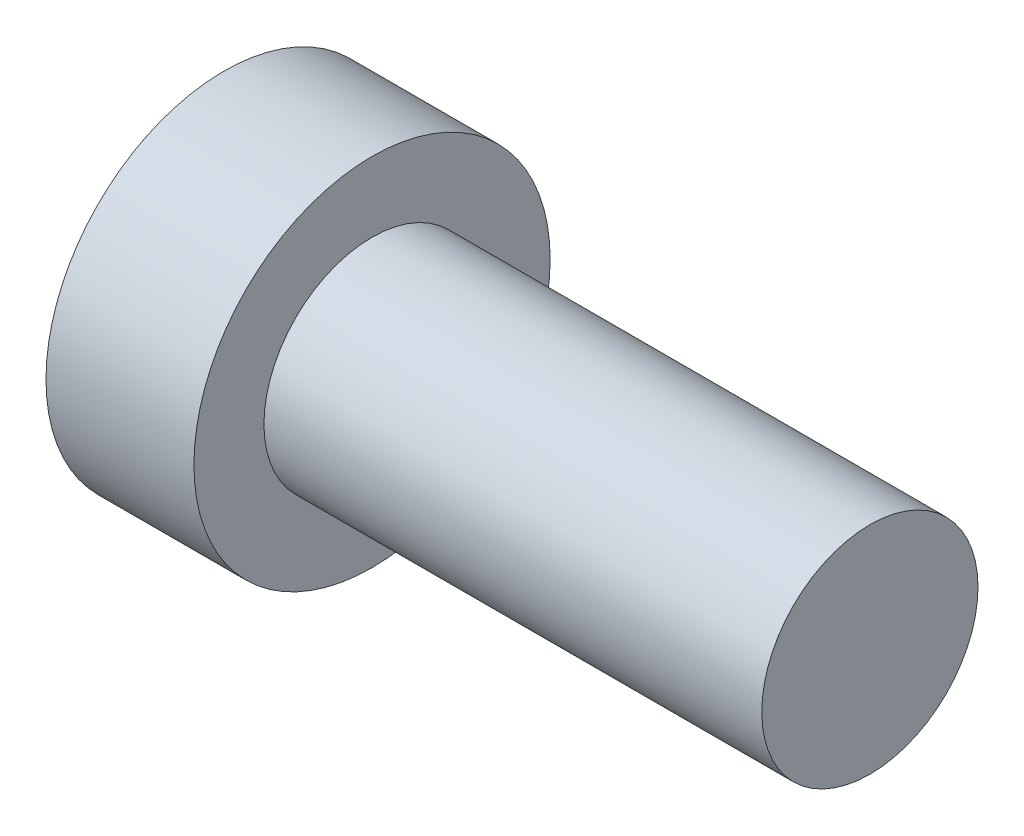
ISO-10303-21;
HEADER;
FILE_DESCRIPTION(('STEP AP214'),'2;1');
FILE_NAME('part.step','',(''),(''),'','','');
FILE_SCHEMA(('AUTOMOTIVE_DESIGN { 1 0 10303 214 1 1 1 1 }'));
ENDSEC;
DATA;
#1=APPLICATION_CONTEXT('core data for automotive mechanical design processes');
#2=APPLICATION_PROTOCOL_DEFINITION('international standard','automotive_design',2000,#1);
#3=PRODUCT_CONTEXT('',#1,'mechanical');
#4=PRODUCT('Part','Part','',(#3));
#5=PRODUCT_RELATED_PRODUCT_CATEGORY('part','',(#4));
#6=PRODUCT_DEFINITION_FORMATION('','',#4);
#7=PRODUCT_DEFINITION_CONTEXT('part definition',#1,'design');
#8=PRODUCT_DEFINITION('design','',#6,#7);
#9=PRODUCT_DEFINITION_SHAPE('','',#8);
#10=(LENGTH_UNIT() NAMED_UNIT(*) SI_UNIT(.MILLI.,.METRE.));
#11=(NAMED_UNIT(*) PLANE_ANGLE_UNIT() SI_UNIT($,.RADIAN.));
#12=(NAMED_UNIT(*) SI_UNIT($,.STERADIAN.) SOLID_ANGLE_UNIT());
#13=UNCERTAINTY_MEASURE_WITH_UNIT(LENGTH_MEASURE(1.E-05),#10,'distance_accuracy_value','');
#14=(GEOMETRIC_REPRESENTATION_CONTEXT(3) GLOBAL_UNCERTAINTY_ASSIGNED_CONTEXT((#13)) GLOBAL_UNIT_ASSIGNED_CONTEXT((#10,
#11,#12)) REPRESENTATION_CONTEXT('',''));
#15=CARTESIAN_POINT('',(0.,0.,0.));
#16=DIRECTION('',(0.,0.,1.));
#17=DIRECTION('',(1.,0.,0.));
#18=AXIS2_PLACEMENT_3D('',#15,#16,#17);
#19=CARTESIAN_POINT('',(6.8560315,0.,0.));
#20=DIRECTION('',(-1.,0.,0.));
#21=DIRECTION('',(0.,1.,0.));
#22=AXIS2_PLACEMENT_3D('',#19,#20,#21);
#23=SPHERICAL_SURFACE('',#22,6.8560315);
#24=CARTESIAN_POINT('',(1.27,0.,0.));
#25=DIRECTION('',(-1.,0.,0.));
#26=DIRECTION('',(0.,0.,1.));
#27=AXIS2_PLACEMENT_3D('',#24,#25,#26);
#28=CIRCLE('',#27,3.9751);
#29=CARTESIAN_POINT('',(1.27,0.,3.9751));
#30=VERTEX_POINT('',#29);
#31=EDGE_CURVE('E150',#30,#30,#28,.T.);
#32=ORIENTED_EDGE('',*,*,#31,.T.);
#33=EDGE_LOOP('',(#32));
#34=FACE_BOUND('',#33,.T.);
#35=CARTESIAN_POINT('',(6.8557192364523,0.,-0.00389240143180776));
#36=DIRECTION('',(-0.0799669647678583,0.,-0.996797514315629));
#37=DIRECTION('',(-0.996797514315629,0.,0.0799669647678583));
#38=AXIS2_PLACEMENT_3D('',#35,#36,#37);
#39=CIRCLE('',#38,6.85603038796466);
#40=CARTESIAN_POINT('',(0.520041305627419,2.57021336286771,0.50438026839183));
#41=VERTEX_POINT('',#40);
#42=CARTESIAN_POINT('',(0.0430847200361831,0.54264357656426,0.542643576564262));
#43=VERTEX_POINT('',#42);
#44=EDGE_CURVE('E159',#41,#43,#39,.F.);
#45=ORIENTED_EDGE('',*,*,#44,.T.);
#46=CARTESIAN_POINT('',(6.8557192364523,-0.00389240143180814,0.));
#47=DIRECTION('',(-0.0799669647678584,-0.996797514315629,0.));
#48=DIRECTION('',(0.996797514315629,-0.0799669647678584,0.));
#49=AXIS2_PLACEMENT_3D('',#46,#47,#48);
#50=CIRCLE('',#49,6.85603038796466);
#51=CARTESIAN_POINT('',(0.520041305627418,0.504380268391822,2.57021336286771));
#52=VERTEX_POINT('',#51);
#53=EDGE_CURVE('E122',#43,#52,#50,.F.);
#54=ORIENTED_EDGE('',*,*,#53,.T.);
#55=CARTESIAN_POINT('',(5.64871740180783,0.,-1.51550434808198));
#56=DIRECTION('',(0.623092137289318,0.,0.782148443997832));
#57=DIRECTION('',(0.782148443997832,0.,-0.623092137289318));
#58=AXIS2_PLACEMENT_3D('',#55,#56,#57);
#59=CIRCLE('',#58,6.57653458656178);
#60=CARTESIAN_POINT('',(0.520041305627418,-0.504380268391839,2.57021336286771));
#61=VERTEX_POINT('',#60);
#62=EDGE_CURVE('E174',#61,#52,#59,.F.);
#63=ORIENTED_EDGE('',*,*,#62,.F.);
#64=CARTESIAN_POINT('',(6.8557192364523,0.00389240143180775,0.));
#65=DIRECTION('',(-0.0799669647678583,0.996797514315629,0.));
#66=DIRECTION('',(-0.996797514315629,-0.0799669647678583,0.));
#67=AXIS2_PLACEMENT_3D('',#64,#65,#66);
#68=CIRCLE('',#67,6.85603038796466);
#69=CARTESIAN_POINT('',(0.0430847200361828,-0.542643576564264,0.542643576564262));
#70=VERTEX_POINT('',#69);
#71=EDGE_CURVE('E172',#61,#70,#68,.F.);
#72=ORIENTED_EDGE('',*,*,#71,.T.);
#73=CARTESIAN_POINT('',(0.520041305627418,-2.57021336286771,0.50438026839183));
#74=VERTEX_POINT('',#73);
#75=EDGE_CURVE('E158',#70,#74,#39,.F.);
#76=ORIENTED_EDGE('',*,*,#75,.T.);
#77=CARTESIAN_POINT('',(5.64871740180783,1.51550434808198,0.));
#78=DIRECTION('',(0.623092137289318,-0.782148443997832,0.));
#79=DIRECTION('',(0.782148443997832,0.623092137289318,0.));
#80=AXIS2_PLACEMENT_3D('',#77,#78,#79);
#81=CIRCLE('',#80,6.57653458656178);
#82=CARTESIAN_POINT('',(0.520041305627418,-2.57021336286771,-0.504380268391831));
#83=VERTEX_POINT('',#82);
#84=EDGE_CURVE('E156',#83,#74,#81,.F.);
#85=ORIENTED_EDGE('',*,*,#84,.F.);
#86=CARTESIAN_POINT('',(6.8557192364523,0.,0.00389240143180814));
#87=DIRECTION('',(-0.0799669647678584,0.,0.996797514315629));
#88=DIRECTION('',(0.996797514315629,0.,0.0799669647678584));
#89=AXIS2_PLACEMENT_3D('',#86,#87,#88);
#90=CIRCLE('',#89,6.85603038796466);
#91=CARTESIAN_POINT('',(0.0430847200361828,-0.54264357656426,-0.542643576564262));
#92=VERTEX_POINT('',#91);
#93=EDGE_CURVE('E162',#83,#92,#90,.F.);
#94=ORIENTED_EDGE('',*,*,#93,.T.);
#95=CARTESIAN_POINT('',(0.520041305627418,-0.504380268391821,-2.57021336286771));
#96=VERTEX_POINT('',#95);
#97=EDGE_CURVE('E166',#92,#96,#68,.F.);
#98=ORIENTED_EDGE('',*,*,#97,.T.);
#99=CARTESIAN_POINT('',(5.64871740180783,0.,1.51550434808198));
#100=DIRECTION('',(0.623092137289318,0.,-0.782148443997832));
#101=DIRECTION('',(-0.782148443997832,0.,-0.623092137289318));
#102=AXIS2_PLACEMENT_3D('',#99,#100,#101);
#103=CIRCLE('',#102,6.57653458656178);
#104=CARTESIAN_POINT('',(0.520041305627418,0.50438026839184,-2.57021336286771));
#105=VERTEX_POINT('',#104);
#106=EDGE_CURVE('E190',#105,#96,#103,.F.);
#107=ORIENTED_EDGE('',*,*,#106,.F.);
#108=CARTESIAN_POINT('',(0.0430847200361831,0.542643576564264,-0.542643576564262));
#109=VERTEX_POINT('',#108);
#110=EDGE_CURVE('E101',#105,#109,#50,.F.);
#111=ORIENTED_EDGE('',*,*,#110,.T.);
#112=CARTESIAN_POINT('',(0.520041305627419,2.57021336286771,-0.504380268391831));
#113=VERTEX_POINT('',#112);
#114=EDGE_CURVE('E51',#109,#113,#90,.F.);
#115=ORIENTED_EDGE('',*,*,#114,.T.);
#116=CARTESIAN_POINT('',(5.64871740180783,-1.51550434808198,0.));
#117=DIRECTION('',(0.623092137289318,0.782148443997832,0.));
#118=DIRECTION('',(-0.782148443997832,0.623092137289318,0.));
#119=AXIS2_PLACEMENT_3D('',#116,#117,#118);
#120=CIRCLE('',#119,6.57653458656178);
#121=EDGE_CURVE('E36',#41,#113,#120,.F.);
#122=ORIENTED_EDGE('',*,*,#121,.F.);
#123=EDGE_LOOP('',(#45,#54,#63,#72,#76,#85,#94,#98,#107,#111,#115,#122));
#124=FACE_BOUND('',#123,.T.);
#125=ADVANCED_FACE('F28',(#34,#124),#23,.T.);
#126=CARTESIAN_POINT('',(3.74635128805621,0.,-0.245553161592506));
#127=DIRECTION('',(-0.0799669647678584,0.,0.996797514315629));
#128=DIRECTION('',(0.996797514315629,0.,0.0799669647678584));
#129=AXIS2_PLACEMENT_3D('',#126,#127,#128);
#130=PLANE('',#129);
#131=ORIENTED_EDGE('',*,*,#114,.F.);
#132=DIRECTION('',(0.993625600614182,-0.0797125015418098,0.0797125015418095));
#133=VECTOR('',#132,1.);
#134=CARTESIAN_POINT('',(3.76580017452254,0.243992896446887,-0.243992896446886));
#135=LINE('',#134,#133);
#136=CARTESIAN_POINT('',(3.4036,0.273050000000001,-0.273049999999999));
#137=VERTEX_POINT('',#136);
#138=EDGE_CURVE('E100',#109,#137,#135,.T.);
#139=ORIENTED_EDGE('',*,*,#138,.T.);
#140=DIRECTION('',(0.780613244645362,-0.621869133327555,0.062623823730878));
#141=VECTOR('',#140,1.);
#142=CARTESIAN_POINT('',(0.,2.9845,-0.546100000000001));
#143=LINE('',#142,#141);
#144=EDGE_CURVE('E121',#113,#137,#143,.T.);
#145=ORIENTED_EDGE('',*,*,#144,.F.);
#146=EDGE_LOOP('',(#131,#139,#145));
#147=FACE_BOUND('',#146,.T.);
#148=ADVANCED_FACE('F120',(#147),#130,.T.);
#149=DIRECTION('',(0.780613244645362,0.621869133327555,0.062623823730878));
#150=VECTOR('',#149,1.);
#151=CARTESIAN_POINT('',(0.,-2.9845,-0.546100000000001));
#152=LINE('',#151,#150);
#153=CARTESIAN_POINT('',(3.4036,-0.27305,-0.27305));
#154=VERTEX_POINT('',#153);
#155=EDGE_CURVE('E43',#83,#154,#152,.T.);
#156=ORIENTED_EDGE('',*,*,#155,.T.);
#157=DIRECTION('',(-0.993625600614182,-0.0797125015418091,-0.0797125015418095));
#158=VECTOR('',#157,1.);
#159=CARTESIAN_POINT('',(3.76580017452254,-0.243992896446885,-0.243992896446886));
#160=LINE('',#159,#158);
#161=EDGE_CURVE('E170',#154,#92,#160,.T.);
#162=ORIENTED_EDGE('',*,*,#161,.T.);
#163=ORIENTED_EDGE('',*,*,#93,.F.);
#164=EDGE_LOOP('',(#156,#162,#163));
#165=FACE_BOUND('',#164,.T.);
#166=ADVANCED_FACE('F169',(#165),#130,.T.);
#167=CARTESIAN_POINT('',(3.74635128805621,0.,0.245553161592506));
#168=DIRECTION('',(-0.0799669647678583,0.,-0.996797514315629));
#169=DIRECTION('',(-0.996797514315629,0.,0.0799669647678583));
#170=AXIS2_PLACEMENT_3D('',#167,#168,#169);
#171=PLANE('',#170);
#172=DIRECTION('',(0.780613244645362,-0.621869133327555,-0.062623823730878));
#173=VECTOR('',#172,1.);
#174=CARTESIAN_POINT('',(0.,2.9845,0.5461));
#175=LINE('',#174,#173);
#176=CARTESIAN_POINT('',(3.4036,0.273049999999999,0.273050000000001));
#177=VERTEX_POINT('',#176);
#178=EDGE_CURVE('E129',#41,#177,#175,.T.);
#179=ORIENTED_EDGE('',*,*,#178,.T.);
#180=DIRECTION('',(-0.993625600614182,0.0797125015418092,0.0797125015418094));
#181=VECTOR('',#180,1.);
#182=CARTESIAN_POINT('',(3.76580017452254,0.243992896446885,0.243992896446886));
#183=LINE('',#182,#181);
#184=EDGE_CURVE('E11',#177,#43,#183,.T.);
#185=ORIENTED_EDGE('',*,*,#184,.T.);
#186=ORIENTED_EDGE('',*,*,#44,.F.);
#187=EDGE_LOOP('',(#179,#185,#186));
#188=FACE_BOUND('',#187,.T.);
#189=ADVANCED_FACE('F204',(#188),#171,.T.);
#190=ORIENTED_EDGE('',*,*,#75,.F.);
#191=DIRECTION('',(0.993625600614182,0.0797125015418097,-0.0797125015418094));
#192=VECTOR('',#191,1.);
#193=CARTESIAN_POINT('',(3.76580017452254,-0.243992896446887,0.243992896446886));
#194=LINE('',#193,#192);
#195=CARTESIAN_POINT('',(3.4036,-0.27305,0.27305));
#196=VERTEX_POINT('',#195);
#197=EDGE_CURVE('E177',#70,#196,#194,.T.);
#198=ORIENTED_EDGE('',*,*,#197,.T.);
#199=DIRECTION('',(0.780613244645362,0.621869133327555,-0.0626238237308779));
#200=VECTOR('',#199,1.);
#201=CARTESIAN_POINT('',(0.,-2.9845,0.5461));
#202=LINE('',#201,#200);
#203=EDGE_CURVE('E139',#74,#196,#202,.T.);
#204=ORIENTED_EDGE('',*,*,#203,.F.);
#205=EDGE_LOOP('',(#190,#198,#204));
#206=FACE_BOUND('',#205,.T.);
#207=ADVANCED_FACE('F187',(#206),#171,.T.);
#208=CARTESIAN_POINT('',(-25.4,0.,0.));
#209=DIRECTION('',(-1.,0.,0.));
#210=DIRECTION('',(0.,0.,1.));
#211=AXIS2_PLACEMENT_3D('',#208,#209,#210);
#212=CYLINDRICAL_SURFACE('',#211,2.413);
#213=CARTESIAN_POINT('',(15.6845,0.,0.));
#214=DIRECTION('',(-1.,0.,0.));
#215=DIRECTION('',(0.,0.,1.));
#216=AXIS2_PLACEMENT_3D('',#213,#214,#215);
#217=CIRCLE('',#216,2.413);
#218=CARTESIAN_POINT('',(15.6845,0.,2.413));
#219=VERTEX_POINT('',#218);
#220=EDGE_CURVE('E153',#219,#219,#217,.T.);
#221=ORIENTED_EDGE('',*,*,#220,.T.);
#222=EDGE_LOOP('',(#221));
#223=FACE_BOUND('',#222,.T.);
#224=CARTESIAN_POINT('',(4.572,0.,0.));
#225=DIRECTION('',(-1.,0.,0.));
#226=DIRECTION('',(0.,0.,1.));
#227=AXIS2_PLACEMENT_3D('',#224,#225,#226);
#228=CIRCLE('',#227,2.413);
#229=CARTESIAN_POINT('',(4.572,0.,2.413));
#230=VERTEX_POINT('',#229);
#231=EDGE_CURVE('E128',#230,#230,#228,.T.);
#232=ORIENTED_EDGE('',*,*,#231,.F.);
#233=EDGE_LOOP('',(#232));
#234=FACE_BOUND('',#233,.T.);
#235=ADVANCED_FACE('F30',(#223,#234),#212,.T.);
#236=CARTESIAN_POINT('',(15.6845,2.413,0.));
#237=DIRECTION('',(1.,0.,0.));
#238=DIRECTION('',(0.,0.,-1.));
#239=AXIS2_PLACEMENT_3D('',#236,#237,#238);
#240=PLANE('',#239);
#241=ORIENTED_EDGE('',*,*,#220,.F.);
#242=EDGE_LOOP('',(#241));
#243=FACE_BOUND('',#242,.T.);
#244=ADVANCED_FACE('F231',(#243),#240,.T.);
#245=CARTESIAN_POINT('',(-25.4,0.,0.));
#246=DIRECTION('',(-1.,0.,0.));
#247=DIRECTION('',(0.,0.,1.));
#248=AXIS2_PLACEMENT_3D('',#245,#246,#247);
#249=CYLINDRICAL_SURFACE('',#248,3.9751);
#250=ORIENTED_EDGE('',*,*,#31,.F.);
#251=EDGE_LOOP('',(#250));
#252=FACE_BOUND('',#251,.T.);
#253=CARTESIAN_POINT('',(4.572,0.,0.));
#254=DIRECTION('',(-1.,0.,0.));
#255=DIRECTION('',(0.,0.,1.));
#256=AXIS2_PLACEMENT_3D('',#253,#254,#255);
#257=CIRCLE('',#256,3.9751);
#258=CARTESIAN_POINT('',(4.572,0.,3.9751));
#259=VERTEX_POINT('',#258);
#260=EDGE_CURVE('E147',#259,#259,#257,.T.);
#261=ORIENTED_EDGE('',*,*,#260,.T.);
#262=EDGE_LOOP('',(#261));
#263=FACE_BOUND('',#262,.T.);
#264=ADVANCED_FACE('F229',(#252,#263),#249,.T.);
#265=CARTESIAN_POINT('',(4.572,2.413,0.));
#266=DIRECTION('',(-1.,0.,0.));
#267=DIRECTION('',(0.,0.,1.));
#268=AXIS2_PLACEMENT_3D('',#265,#266,#267);
#269=PLANE('',#268);
#270=ORIENTED_EDGE('',*,*,#260,.F.);
#271=EDGE_LOOP('',(#270));
#272=FACE_BOUND('',#271,.T.);
#273=ORIENTED_EDGE('',*,*,#231,.T.);
#274=EDGE_LOOP('',(#273));
#275=FACE_BOUND('',#274,.T.);
#276=ADVANCED_FACE('F238',(#272,#275),#269,.F.);
#277=CARTESIAN_POINT('',(3.4036,0.27305,-0.27305));
#278=DIRECTION('',(-1.,0.,0.));
#279=DIRECTION('',(0.,0.,1.));
#280=AXIS2_PLACEMENT_3D('',#277,#278,#279);
#281=PLANE('',#280);
#282=DIRECTION('',(0.,1.,0.));
#283=VECTOR('',#282,1.);
#284=CARTESIAN_POINT('',(3.4036,-0.27305,-0.27305));
#285=LINE('',#284,#283);
#286=EDGE_CURVE('E108',#154,#137,#285,.T.);
#287=ORIENTED_EDGE('',*,*,#286,.F.);
#288=DIRECTION('',(0.,0.,1.));
#289=VECTOR('',#288,1.);
#290=CARTESIAN_POINT('',(3.4036,-0.27305,-0.27305));
#291=LINE('',#290,#289);
#292=EDGE_CURVE('E135',#154,#196,#291,.T.);
#293=ORIENTED_EDGE('',*,*,#292,.T.);
#294=DIRECTION('',(0.,-1.,0.));
#295=VECTOR('',#294,1.);
#296=CARTESIAN_POINT('',(3.4036,0.27305,0.27305));
#297=LINE('',#296,#295);
#298=EDGE_CURVE('E133',#177,#196,#297,.T.);
#299=ORIENTED_EDGE('',*,*,#298,.F.);
#300=DIRECTION('',(0.,0.,-1.));
#301=VECTOR('',#300,1.);
#302=CARTESIAN_POINT('',(3.4036,0.27305,0.27305));
#303=LINE('',#302,#301);
#304=EDGE_CURVE('E115',#177,#137,#303,.T.);
#305=ORIENTED_EDGE('',*,*,#304,.T.);
#306=EDGE_LOOP('',(#287,#293,#299,#305));
#307=FACE_BOUND('',#306,.T.);
#308=ADVANCED_FACE('F132',(#307),#281,.T.);
#309=CARTESIAN_POINT('',(3.4036,0.27305,0.27305));
#310=DIRECTION('',(0.623092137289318,0.782148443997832,0.));
#311=DIRECTION('',(-0.782148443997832,0.623092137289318,0.));
#312=AXIS2_PLACEMENT_3D('',#309,#310,#311);
#313=PLANE('',#312);
#314=ORIENTED_EDGE('',*,*,#121,.T.);
#315=ORIENTED_EDGE('',*,*,#144,.T.);
#316=ORIENTED_EDGE('',*,*,#304,.F.);
#317=ORIENTED_EDGE('',*,*,#178,.F.);
#318=EDGE_LOOP('',(#314,#315,#316,#317));
#319=FACE_BOUND('',#318,.T.);
#320=ADVANCED_FACE('F126',(#319),#313,.F.);
#321=CARTESIAN_POINT('',(3.4036,-0.27305,-0.27305));
#322=DIRECTION('',(0.623092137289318,-0.782148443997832,0.));
#323=DIRECTION('',(0.782148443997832,0.623092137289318,0.));
#324=AXIS2_PLACEMENT_3D('',#321,#322,#323);
#325=PLANE('',#324);
#326=ORIENTED_EDGE('',*,*,#84,.T.);
#327=ORIENTED_EDGE('',*,*,#203,.T.);
#328=ORIENTED_EDGE('',*,*,#292,.F.);
#329=ORIENTED_EDGE('',*,*,#155,.F.);
#330=EDGE_LOOP('',(#326,#327,#328,#329));
#331=FACE_BOUND('',#330,.T.);
#332=ADVANCED_FACE('F182',(#331),#325,.F.);
#333=CARTESIAN_POINT('',(3.74635128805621,0.245553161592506,0.));
#334=DIRECTION('',(-0.0799669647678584,-0.996797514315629,0.));
#335=DIRECTION('',(0.996797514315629,-0.0799669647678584,0.));
#336=AXIS2_PLACEMENT_3D('',#333,#334,#335);
#337=PLANE('',#336);
#338=ORIENTED_EDGE('',*,*,#184,.F.);
#339=DIRECTION('',(0.780613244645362,-0.0626238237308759,-0.621869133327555));
#340=VECTOR('',#339,1.);
#341=CARTESIAN_POINT('',(0.,0.54609999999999,2.9845));
#342=LINE('',#341,#340);
#343=EDGE_CURVE('E191',#52,#177,#342,.T.);
#344=ORIENTED_EDGE('',*,*,#343,.F.);
#345=ORIENTED_EDGE('',*,*,#53,.F.);
#346=EDGE_LOOP('',(#338,#344,#345));
#347=FACE_BOUND('',#346,.T.);
#348=ADVANCED_FACE('F205',(#347),#337,.T.);
#349=CARTESIAN_POINT('',(3.74635128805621,-0.245553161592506,0.));
#350=DIRECTION('',(-0.0799669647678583,0.996797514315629,0.));
#351=DIRECTION('',(-0.996797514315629,-0.0799669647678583,0.));
#352=AXIS2_PLACEMENT_3D('',#349,#350,#351);
#353=PLANE('',#352);
#354=DIRECTION('',(0.780613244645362,0.0626238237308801,-0.621869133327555));
#355=VECTOR('',#354,1.);
#356=CARTESIAN_POINT('',(0.,-0.546100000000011,2.9845));
#357=LINE('',#356,#355);
#358=EDGE_CURVE('E104',#61,#196,#357,.T.);
#359=ORIENTED_EDGE('',*,*,#358,.T.);
#360=ORIENTED_EDGE('',*,*,#197,.F.);
#361=ORIENTED_EDGE('',*,*,#71,.F.);
#362=EDGE_LOOP('',(#359,#360,#361));
#363=FACE_BOUND('',#362,.T.);
#364=ADVANCED_FACE('F207',(#363),#353,.T.);
#365=CARTESIAN_POINT('',(3.4036,-0.273050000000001,0.273049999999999));
#366=DIRECTION('',(0.623092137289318,0.,0.782148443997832));
#367=DIRECTION('',(-0.782148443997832,0.,0.623092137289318));
#368=AXIS2_PLACEMENT_3D('',#365,#366,#367);
#369=PLANE('',#368);
#370=ORIENTED_EDGE('',*,*,#62,.T.);
#371=ORIENTED_EDGE('',*,*,#343,.T.);
#372=ORIENTED_EDGE('',*,*,#298,.T.);
#373=ORIENTED_EDGE('',*,*,#358,.F.);
#374=EDGE_LOOP('',(#370,#371,#372,#373));
#375=FACE_BOUND('',#374,.T.);
#376=ADVANCED_FACE('F199',(#375),#369,.F.);
#377=DIRECTION('',(0.780613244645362,-0.0626238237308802,0.621869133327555));
#378=VECTOR('',#377,1.);
#379=CARTESIAN_POINT('',(0.,0.546100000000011,-2.9845));
#380=LINE('',#379,#378);
#381=EDGE_CURVE('E96',#105,#137,#380,.T.);
#382=ORIENTED_EDGE('',*,*,#381,.T.);
#383=ORIENTED_EDGE('',*,*,#138,.F.);
#384=ORIENTED_EDGE('',*,*,#110,.F.);
#385=EDGE_LOOP('',(#382,#383,#384));
#386=FACE_BOUND('',#385,.T.);
#387=ADVANCED_FACE('F98',(#386),#337,.T.);
#388=ORIENTED_EDGE('',*,*,#161,.F.);
#389=DIRECTION('',(0.780613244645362,0.0626238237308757,0.621869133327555));
#390=VECTOR('',#389,1.);
#391=CARTESIAN_POINT('',(0.,-0.546099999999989,-2.9845));
#392=LINE('',#391,#390);
#393=EDGE_CURVE('E105',#96,#154,#392,.T.);
#394=ORIENTED_EDGE('',*,*,#393,.F.);
#395=ORIENTED_EDGE('',*,*,#97,.F.);
#396=EDGE_LOOP('',(#388,#394,#395));
#397=FACE_BOUND('',#396,.T.);
#398=ADVANCED_FACE('F214',(#397),#353,.T.);
#399=CARTESIAN_POINT('',(3.4036,0.273050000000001,-0.273049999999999));
#400=DIRECTION('',(0.623092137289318,0.,-0.782148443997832));
#401=DIRECTION('',(0.782148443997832,0.,0.623092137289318));
#402=AXIS2_PLACEMENT_3D('',#399,#400,#401);
#403=PLANE('',#402);
#404=ORIENTED_EDGE('',*,*,#106,.T.);
#405=ORIENTED_EDGE('',*,*,#393,.T.);
#406=ORIENTED_EDGE('',*,*,#286,.T.);
#407=ORIENTED_EDGE('',*,*,#381,.F.);
#408=EDGE_LOOP('',(#404,#405,#406,#407));
#409=FACE_BOUND('',#408,.T.);
#410=ADVANCED_FACE('F109',(#409),#403,.F.);
#411=CLOSED_SHELL('',(#125,#148,#166,#189,#207,#235,#244,#264,#276,#308,#320,#332,#348,#364,
#376,#387,#398,#410));
#412=MANIFOLD_SOLID_BREP('B2',#411);
#413=ADVANCED_BREP_SHAPE_REPRESENTATION('',(#18,#412),#14);
#414=SHAPE_DEFINITION_REPRESENTATION(#9,#413);
ENDSEC;
END-ISO-10303-21;
